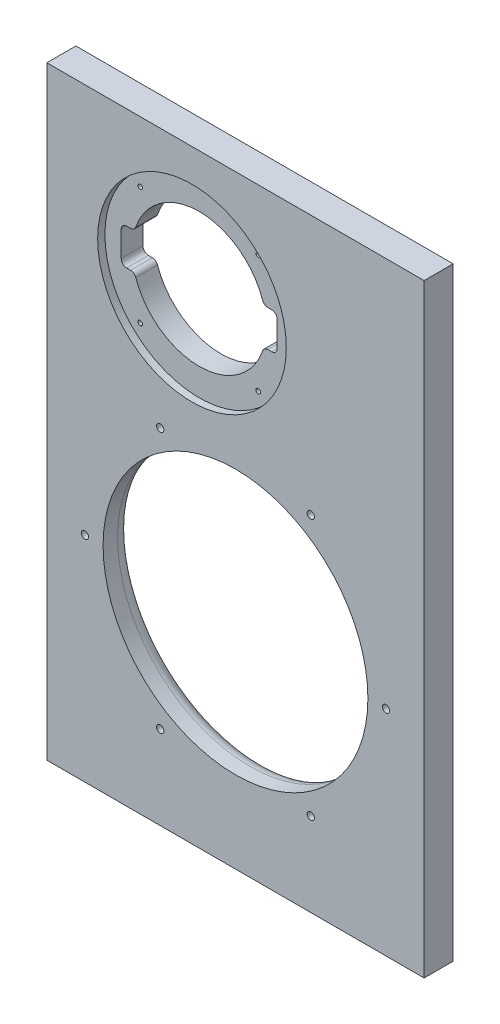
ISO-10303-21;
HEADER;
FILE_DESCRIPTION(('STEP AP214'),'2;1');
FILE_NAME('part.step','',(''),(''),'','','');
FILE_SCHEMA(('AUTOMOTIVE_DESIGN { 1 0 10303 214 1 1 1 1 }'));
ENDSEC;
DATA;
#1=APPLICATION_CONTEXT('core data for automotive mechanical design processes');
#2=APPLICATION_PROTOCOL_DEFINITION('international standard','automotive_design',2000,#1);
#3=PRODUCT_CONTEXT('',#1,'mechanical');
#4=PRODUCT('Part','Part','',(#3));
#5=PRODUCT_RELATED_PRODUCT_CATEGORY('part','',(#4));
#6=PRODUCT_DEFINITION_FORMATION('','',#4);
#7=PRODUCT_DEFINITION_CONTEXT('part definition',#1,'design');
#8=PRODUCT_DEFINITION('design','',#6,#7);
#9=PRODUCT_DEFINITION_SHAPE('','',#8);
#10=(LENGTH_UNIT() NAMED_UNIT(*) SI_UNIT(.MILLI.,.METRE.));
#11=(NAMED_UNIT(*) PLANE_ANGLE_UNIT() SI_UNIT($,.RADIAN.));
#12=(NAMED_UNIT(*) SI_UNIT($,.STERADIAN.) SOLID_ANGLE_UNIT());
#13=UNCERTAINTY_MEASURE_WITH_UNIT(LENGTH_MEASURE(1.E-05),#10,'distance_accuracy_value','');
#14=(GEOMETRIC_REPRESENTATION_CONTEXT(3) GLOBAL_UNCERTAINTY_ASSIGNED_CONTEXT((#13)) GLOBAL_UNIT_ASSIGNED_CONTEXT((#10,
#11,#12)) REPRESENTATION_CONTEXT('',''));
#15=CARTESIAN_POINT('',(0.,0.,0.));
#16=DIRECTION('',(0.,0.,1.));
#17=DIRECTION('',(1.,0.,0.));
#18=AXIS2_PLACEMENT_3D('',#15,#16,#17);
#19=CARTESIAN_POINT('',(40.,-72.997326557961,0.));
#20=DIRECTION('',(0.,0.,1.));
#21=DIRECTION('',(1.,0.,0.));
#22=AXIS2_PLACEMENT_3D('',#19,#20,#21);
#23=CYLINDRICAL_SURFACE('',#22,3.);
#24=CARTESIAN_POINT('',(40.,-72.997326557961,12.));
#25=DIRECTION('',(0.,0.,1.));
#26=DIRECTION('',(1.,0.,0.));
#27=AXIS2_PLACEMENT_3D('',#24,#25,#26);
#28=CIRCLE('',#27,3.);
#29=CARTESIAN_POINT('',(37.,-72.997326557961,12.));
#30=VERTEX_POINT('',#29);
#31=CARTESIAN_POINT('',(40.,-69.997326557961,12.));
#32=VERTEX_POINT('',#31);
#33=EDGE_CURVE('E187',#30,#32,#28,.F.);
#34=ORIENTED_EDGE('',*,*,#33,.F.);
#35=DIRECTION('',(0.,0.,1.));
#36=VECTOR('',#35,1.);
#37=CARTESIAN_POINT('',(37.,-72.997326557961,0.));
#38=LINE('',#37,#36);
#39=CARTESIAN_POINT('',(37.,-72.997326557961,0.));
#40=VERTEX_POINT('',#39);
#41=EDGE_CURVE('E201',#40,#30,#38,.T.);
#42=ORIENTED_EDGE('',*,*,#41,.F.);
#43=CARTESIAN_POINT('',(40.,-72.997326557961,0.));
#44=DIRECTION('',(0.,0.,1.));
#45=DIRECTION('',(-1.,0.,0.));
#46=AXIS2_PLACEMENT_3D('',#43,#44,#45);
#47=CIRCLE('',#46,3.);
#48=CARTESIAN_POINT('',(40.,-69.997326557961,0.));
#49=VERTEX_POINT('',#48);
#50=EDGE_CURVE('E204',#49,#40,#47,.T.);
#51=ORIENTED_EDGE('',*,*,#50,.F.);
#52=DIRECTION('',(0.,0.,1.));
#53=VECTOR('',#52,1.);
#54=CARTESIAN_POINT('',(40.,-69.997326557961,0.));
#55=LINE('',#54,#53);
#56=EDGE_CURVE('E203',#49,#32,#55,.T.);
#57=ORIENTED_EDGE('',*,*,#56,.T.);
#58=EDGE_LOOP('',(#34,#42,#51,#57));
#59=FACE_BOUND('',#58,.T.);
#60=ADVANCED_FACE('F31',(#59),#23,.F.);
#61=CARTESIAN_POINT('',(40.,-69.997326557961,0.));
#62=DIRECTION('',(0.,1.,0.));
#63=DIRECTION('',(0.,0.,1.));
#64=AXIS2_PLACEMENT_3D('',#61,#62,#63);
#65=PLANE('',#64);
#66=DIRECTION('',(1.,0.,0.));
#67=VECTOR('',#66,1.);
#68=CARTESIAN_POINT('',(40.,-69.997326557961,12.));
#69=LINE('',#68,#67);
#70=CARTESIAN_POINT('',(42.1714393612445,-69.997326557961,12.));
#71=VERTEX_POINT('',#70);
#72=EDGE_CURVE('E205',#32,#71,#69,.T.);
#73=ORIENTED_EDGE('',*,*,#72,.F.);
#74=ORIENTED_EDGE('',*,*,#56,.F.);
#75=DIRECTION('',(-1.,0.,0.));
#76=VECTOR('',#75,1.);
#77=CARTESIAN_POINT('',(40.,-69.997326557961,0.));
#78=LINE('',#77,#76);
#79=CARTESIAN_POINT('',(42.1714393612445,-69.997326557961,0.));
#80=VERTEX_POINT('',#79);
#81=EDGE_CURVE('E212',#80,#49,#78,.T.);
#82=ORIENTED_EDGE('',*,*,#81,.F.);
#83=DIRECTION('',(0.,0.,1.));
#84=VECTOR('',#83,1.);
#85=CARTESIAN_POINT('',(42.1714393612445,-69.997326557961,0.));
#86=LINE('',#85,#84);
#87=EDGE_CURVE('E377',#80,#71,#86,.T.);
#88=ORIENTED_EDGE('',*,*,#87,.T.);
#89=EDGE_LOOP('',(#73,#74,#82,#88));
#90=FACE_BOUND('',#89,.T.);
#91=ADVANCED_FACE('F423',(#90),#65,.F.);
#92=CARTESIAN_POINT('',(42.1714393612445,-66.9973265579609,0.));
#93=DIRECTION('',(0.,0.,1.));
#94=DIRECTION('',(1.,0.,0.));
#95=AXIS2_PLACEMENT_3D('',#92,#93,#94);
#96=CYLINDRICAL_SURFACE('',#95,3.);
#97=CARTESIAN_POINT('',(42.1714393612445,-66.9973265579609,12.));
#98=DIRECTION('',(0.,0.,1.));
#99=DIRECTION('',(1.,0.,0.));
#100=AXIS2_PLACEMENT_3D('',#97,#98,#99);
#101=CIRCLE('',#100,3.);
#102=CARTESIAN_POINT('',(45.0085814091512,-67.972326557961,12.));
#103=VERTEX_POINT('',#102);
#104=EDGE_CURVE('E333',#71,#103,#101,.T.);
#105=ORIENTED_EDGE('',*,*,#104,.F.);
#106=ORIENTED_EDGE('',*,*,#87,.F.);
#107=CARTESIAN_POINT('',(42.1714393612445,-66.9973265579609,0.));
#108=DIRECTION('',(0.,0.,-1.));
#109=DIRECTION('',(1.,0.,0.));
#110=AXIS2_PLACEMENT_3D('',#107,#108,#109);
#111=CIRCLE('',#110,3.);
#112=CARTESIAN_POINT('',(45.0085814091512,-67.972326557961,0.));
#113=VERTEX_POINT('',#112);
#114=EDGE_CURVE('E217',#113,#80,#111,.T.);
#115=ORIENTED_EDGE('',*,*,#114,.F.);
#116=DIRECTION('',(0.,0.,1.));
#117=VECTOR('',#116,1.);
#118=CARTESIAN_POINT('',(45.0085814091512,-67.972326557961,0.));
#119=LINE('',#118,#117);
#120=EDGE_CURVE('E380',#113,#103,#119,.T.);
#121=ORIENTED_EDGE('',*,*,#120,.T.);
#122=EDGE_LOOP('',(#105,#106,#115,#121));
#123=FACE_BOUND('',#122,.T.);
#124=ADVANCED_FACE('F427',(#123),#96,.T.);
#125=CARTESIAN_POINT('',(80.,-79.997326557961,0.));
#126=DIRECTION('',(0.,0.,1.));
#127=DIRECTION('',(1.,0.,0.));
#128=AXIS2_PLACEMENT_3D('',#125,#126,#127);
#129=CYLINDRICAL_SURFACE('',#128,37.);
#130=CARTESIAN_POINT('',(80.,-79.997326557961,12.));
#131=DIRECTION('',(0.,0.,1.));
#132=DIRECTION('',(1.,0.,0.));
#133=AXIS2_PLACEMENT_3D('',#130,#131,#132);
#134=CIRCLE('',#133,37.);
#135=CARTESIAN_POINT('',(114.991418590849,-67.972326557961,12.));
#136=VERTEX_POINT('',#135);
#137=EDGE_CURVE('E331',#103,#136,#134,.F.);
#138=ORIENTED_EDGE('',*,*,#137,.F.);
#139=ORIENTED_EDGE('',*,*,#120,.F.);
#140=CARTESIAN_POINT('',(80.,-79.997326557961,0.));
#141=DIRECTION('',(0.,0.,1.));
#142=DIRECTION('',(1.,0.,0.));
#143=AXIS2_PLACEMENT_3D('',#140,#141,#142);
#144=CIRCLE('',#143,37.);
#145=CARTESIAN_POINT('',(114.991418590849,-67.972326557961,0.));
#146=VERTEX_POINT('',#145);
#147=EDGE_CURVE('E371',#146,#113,#144,.T.);
#148=ORIENTED_EDGE('',*,*,#147,.F.);
#149=DIRECTION('',(0.,0.,1.));
#150=VECTOR('',#149,1.);
#151=CARTESIAN_POINT('',(114.991418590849,-67.972326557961,0.));
#152=LINE('',#151,#150);
#153=EDGE_CURVE('E383',#146,#136,#152,.T.);
#154=ORIENTED_EDGE('',*,*,#153,.T.);
#155=EDGE_LOOP('',(#138,#139,#148,#154));
#156=FACE_BOUND('',#155,.T.);
#157=ADVANCED_FACE('F430',(#156),#129,.F.);
#158=CARTESIAN_POINT('',(117.828560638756,-66.9973265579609,0.));
#159=DIRECTION('',(0.,0.,1.));
#160=DIRECTION('',(1.,0.,0.));
#161=AXIS2_PLACEMENT_3D('',#158,#159,#160);
#162=CYLINDRICAL_SURFACE('',#161,3.);
#163=CARTESIAN_POINT('',(117.828560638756,-66.9973265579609,12.));
#164=DIRECTION('',(0.,0.,1.));
#165=DIRECTION('',(1.,0.,0.));
#166=AXIS2_PLACEMENT_3D('',#163,#164,#165);
#167=CIRCLE('',#166,3.);
#168=CARTESIAN_POINT('',(117.828560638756,-69.997326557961,12.));
#169=VERTEX_POINT('',#168);
#170=EDGE_CURVE('E329',#136,#169,#167,.T.);
#171=ORIENTED_EDGE('',*,*,#170,.F.);
#172=ORIENTED_EDGE('',*,*,#153,.F.);
#173=CARTESIAN_POINT('',(117.828560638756,-66.9973265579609,0.));
#174=DIRECTION('',(0.,0.,-1.));
#175=DIRECTION('',(1.,0.,0.));
#176=AXIS2_PLACEMENT_3D('',#173,#174,#175);
#177=CIRCLE('',#176,3.);
#178=CARTESIAN_POINT('',(117.828560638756,-69.997326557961,0.));
#179=VERTEX_POINT('',#178);
#180=EDGE_CURVE('E368',#179,#146,#177,.T.);
#181=ORIENTED_EDGE('',*,*,#180,.F.);
#182=DIRECTION('',(0.,0.,1.));
#183=VECTOR('',#182,1.);
#184=CARTESIAN_POINT('',(117.828560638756,-69.997326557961,0.));
#185=LINE('',#184,#183);
#186=EDGE_CURVE('E386',#179,#169,#185,.T.);
#187=ORIENTED_EDGE('',*,*,#186,.T.);
#188=EDGE_LOOP('',(#171,#172,#181,#187));
#189=FACE_BOUND('',#188,.T.);
#190=ADVANCED_FACE('F434',(#189),#162,.T.);
#191=CARTESIAN_POINT('',(117.828560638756,-69.997326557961,0.));
#192=DIRECTION('',(0.,1.,0.));
#193=DIRECTION('',(0.,0.,1.));
#194=AXIS2_PLACEMENT_3D('',#191,#192,#193);
#195=PLANE('',#194);
#196=DIRECTION('',(1.,0.,0.));
#197=VECTOR('',#196,1.);
#198=CARTESIAN_POINT('',(117.828560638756,-69.997326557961,12.));
#199=LINE('',#198,#197);
#200=CARTESIAN_POINT('',(120.,-69.997326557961,12.));
#201=VERTEX_POINT('',#200);
#202=EDGE_CURVE('E327',#169,#201,#199,.T.);
#203=ORIENTED_EDGE('',*,*,#202,.F.);
#204=ORIENTED_EDGE('',*,*,#186,.F.);
#205=DIRECTION('',(-1.,0.,0.));
#206=VECTOR('',#205,1.);
#207=CARTESIAN_POINT('',(117.828560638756,-69.997326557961,0.));
#208=LINE('',#207,#206);
#209=CARTESIAN_POINT('',(120.,-69.997326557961,0.));
#210=VERTEX_POINT('',#209);
#211=EDGE_CURVE('E365',#210,#179,#208,.T.);
#212=ORIENTED_EDGE('',*,*,#211,.F.);
#213=DIRECTION('',(0.,0.,1.));
#214=VECTOR('',#213,1.);
#215=CARTESIAN_POINT('',(120.,-69.997326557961,0.));
#216=LINE('',#215,#214);
#217=EDGE_CURVE('E389',#210,#201,#216,.T.);
#218=ORIENTED_EDGE('',*,*,#217,.T.);
#219=EDGE_LOOP('',(#203,#204,#212,#218));
#220=FACE_BOUND('',#219,.T.);
#221=ADVANCED_FACE('F438',(#220),#195,.F.);
#222=CARTESIAN_POINT('',(120.,-72.997326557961,0.));
#223=DIRECTION('',(0.,0.,1.));
#224=DIRECTION('',(1.,0.,0.));
#225=AXIS2_PLACEMENT_3D('',#222,#223,#224);
#226=CYLINDRICAL_SURFACE('',#225,3.);
#227=CARTESIAN_POINT('',(120.,-72.997326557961,12.));
#228=DIRECTION('',(0.,0.,1.));
#229=DIRECTION('',(1.,0.,0.));
#230=AXIS2_PLACEMENT_3D('',#227,#228,#229);
#231=CIRCLE('',#230,3.);
#232=CARTESIAN_POINT('',(123.,-72.997326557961,12.));
#233=VERTEX_POINT('',#232);
#234=EDGE_CURVE('E325',#201,#233,#231,.F.);
#235=ORIENTED_EDGE('',*,*,#234,.F.);
#236=ORIENTED_EDGE('',*,*,#217,.F.);
#237=CARTESIAN_POINT('',(120.,-72.997326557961,0.));
#238=DIRECTION('',(0.,0.,1.));
#239=DIRECTION('',(1.,0.,0.));
#240=AXIS2_PLACEMENT_3D('',#237,#238,#239);
#241=CIRCLE('',#240,3.);
#242=CARTESIAN_POINT('',(123.,-72.997326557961,0.));
#243=VERTEX_POINT('',#242);
#244=EDGE_CURVE('E362',#243,#210,#241,.T.);
#245=ORIENTED_EDGE('',*,*,#244,.F.);
#246=DIRECTION('',(0.,0.,1.));
#247=VECTOR('',#246,1.);
#248=CARTESIAN_POINT('',(123.,-72.997326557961,0.));
#249=LINE('',#248,#247);
#250=EDGE_CURVE('E392',#243,#233,#249,.T.);
#251=ORIENTED_EDGE('',*,*,#250,.T.);
#252=EDGE_LOOP('',(#235,#236,#245,#251));
#253=FACE_BOUND('',#252,.T.);
#254=ADVANCED_FACE('F442',(#253),#226,.F.);
#255=CARTESIAN_POINT('',(123.,-72.997326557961,0.));
#256=DIRECTION('',(1.,0.,0.));
#257=DIRECTION('',(0.,0.,-1.));
#258=AXIS2_PLACEMENT_3D('',#255,#256,#257);
#259=PLANE('',#258);
#260=DIRECTION('',(0.,-1.,0.));
#261=VECTOR('',#260,1.);
#262=CARTESIAN_POINT('',(123.,-72.997326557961,12.));
#263=LINE('',#262,#261);
#264=CARTESIAN_POINT('',(123.,-86.997326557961,12.));
#265=VERTEX_POINT('',#264);
#266=EDGE_CURVE('E323',#233,#265,#263,.T.);
#267=ORIENTED_EDGE('',*,*,#266,.F.);
#268=ORIENTED_EDGE('',*,*,#250,.F.);
#269=DIRECTION('',(0.,1.,0.));
#270=VECTOR('',#269,1.);
#271=CARTESIAN_POINT('',(123.,-72.997326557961,0.));
#272=LINE('',#271,#270);
#273=CARTESIAN_POINT('',(123.,-86.9973265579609,0.));
#274=VERTEX_POINT('',#273);
#275=EDGE_CURVE('E359',#274,#243,#272,.T.);
#276=ORIENTED_EDGE('',*,*,#275,.F.);
#277=DIRECTION('',(0.,0.,1.));
#278=VECTOR('',#277,1.);
#279=CARTESIAN_POINT('',(123.,-86.9973265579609,0.));
#280=LINE('',#279,#278);
#281=EDGE_CURVE('E395',#274,#265,#280,.T.);
#282=ORIENTED_EDGE('',*,*,#281,.T.);
#283=EDGE_LOOP('',(#267,#268,#276,#282));
#284=FACE_BOUND('',#283,.T.);
#285=ADVANCED_FACE('F446',(#284),#259,.F.);
#286=CARTESIAN_POINT('',(120.,-86.997326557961,0.));
#287=DIRECTION('',(0.,0.,1.));
#288=DIRECTION('',(1.,0.,0.));
#289=AXIS2_PLACEMENT_3D('',#286,#287,#288);
#290=CYLINDRICAL_SURFACE('',#289,3.);
#291=CARTESIAN_POINT('',(120.,-86.997326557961,12.));
#292=DIRECTION('',(0.,0.,1.));
#293=DIRECTION('',(1.,0.,0.));
#294=AXIS2_PLACEMENT_3D('',#291,#292,#293);
#295=CIRCLE('',#294,3.);
#296=CARTESIAN_POINT('',(120.,-89.997326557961,12.));
#297=VERTEX_POINT('',#296);
#298=EDGE_CURVE('E321',#265,#297,#295,.F.);
#299=ORIENTED_EDGE('',*,*,#298,.F.);
#300=ORIENTED_EDGE('',*,*,#281,.F.);
#301=CARTESIAN_POINT('',(120.,-86.997326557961,0.));
#302=DIRECTION('',(0.,0.,1.));
#303=DIRECTION('',(-1.,0.,0.));
#304=AXIS2_PLACEMENT_3D('',#301,#302,#303);
#305=CIRCLE('',#304,3.);
#306=CARTESIAN_POINT('',(120.,-89.997326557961,0.));
#307=VERTEX_POINT('',#306);
#308=EDGE_CURVE('E356',#307,#274,#305,.T.);
#309=ORIENTED_EDGE('',*,*,#308,.F.);
#310=DIRECTION('',(0.,0.,1.));
#311=VECTOR('',#310,1.);
#312=CARTESIAN_POINT('',(120.,-89.997326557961,0.));
#313=LINE('',#312,#311);
#314=EDGE_CURVE('E398',#307,#297,#313,.T.);
#315=ORIENTED_EDGE('',*,*,#314,.T.);
#316=EDGE_LOOP('',(#299,#300,#309,#315));
#317=FACE_BOUND('',#316,.T.);
#318=ADVANCED_FACE('F450',(#317),#290,.F.);
#319=CARTESIAN_POINT('',(117.828560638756,-89.997326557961,0.));
#320=DIRECTION('',(0.,-1.,0.));
#321=DIRECTION('',(0.,0.,-1.));
#322=AXIS2_PLACEMENT_3D('',#319,#320,#321);
#323=PLANE('',#322);
#324=DIRECTION('',(-1.,0.,0.));
#325=VECTOR('',#324,1.);
#326=CARTESIAN_POINT('',(117.828560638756,-89.997326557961,12.));
#327=LINE('',#326,#325);
#328=CARTESIAN_POINT('',(117.828560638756,-89.997326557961,12.));
#329=VERTEX_POINT('',#328);
#330=EDGE_CURVE('E319',#297,#329,#327,.T.);
#331=ORIENTED_EDGE('',*,*,#330,.F.);
#332=ORIENTED_EDGE('',*,*,#314,.F.);
#333=DIRECTION('',(1.,0.,0.));
#334=VECTOR('',#333,1.);
#335=CARTESIAN_POINT('',(117.828560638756,-89.997326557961,0.));
#336=LINE('',#335,#334);
#337=CARTESIAN_POINT('',(117.828560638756,-89.997326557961,0.));
#338=VERTEX_POINT('',#337);
#339=EDGE_CURVE('E353',#338,#307,#336,.T.);
#340=ORIENTED_EDGE('',*,*,#339,.F.);
#341=DIRECTION('',(0.,0.,1.));
#342=VECTOR('',#341,1.);
#343=CARTESIAN_POINT('',(117.828560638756,-89.997326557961,0.));
#344=LINE('',#343,#342);
#345=EDGE_CURVE('E401',#338,#329,#344,.T.);
#346=ORIENTED_EDGE('',*,*,#345,.T.);
#347=EDGE_LOOP('',(#331,#332,#340,#346));
#348=FACE_BOUND('',#347,.T.);
#349=ADVANCED_FACE('F454',(#348),#323,.F.);
#350=CARTESIAN_POINT('',(117.828560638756,-92.997326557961,0.));
#351=DIRECTION('',(0.,0.,1.));
#352=DIRECTION('',(1.,0.,0.));
#353=AXIS2_PLACEMENT_3D('',#350,#351,#352);
#354=CYLINDRICAL_SURFACE('',#353,3.00000000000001);
#355=CARTESIAN_POINT('',(117.828560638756,-92.997326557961,12.));
#356=DIRECTION('',(0.,0.,1.));
#357=DIRECTION('',(1.,0.,0.));
#358=AXIS2_PLACEMENT_3D('',#355,#356,#357);
#359=CIRCLE('',#358,3.00000000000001);
#360=CARTESIAN_POINT('',(114.991418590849,-92.022326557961,12.));
#361=VERTEX_POINT('',#360);
#362=EDGE_CURVE('E317',#329,#361,#359,.T.);
#363=ORIENTED_EDGE('',*,*,#362,.F.);
#364=ORIENTED_EDGE('',*,*,#345,.F.);
#365=CARTESIAN_POINT('',(117.828560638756,-92.997326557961,0.));
#366=DIRECTION('',(0.,0.,-1.));
#367=DIRECTION('',(-1.,0.,0.));
#368=AXIS2_PLACEMENT_3D('',#365,#366,#367);
#369=CIRCLE('',#368,3.00000000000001);
#370=CARTESIAN_POINT('',(114.991418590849,-92.022326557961,0.));
#371=VERTEX_POINT('',#370);
#372=EDGE_CURVE('E350',#371,#338,#369,.T.);
#373=ORIENTED_EDGE('',*,*,#372,.F.);
#374=DIRECTION('',(0.,0.,1.));
#375=VECTOR('',#374,1.);
#376=CARTESIAN_POINT('',(114.991418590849,-92.022326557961,0.));
#377=LINE('',#376,#375);
#378=EDGE_CURVE('E404',#371,#361,#377,.T.);
#379=ORIENTED_EDGE('',*,*,#378,.T.);
#380=EDGE_LOOP('',(#363,#364,#373,#379));
#381=FACE_BOUND('',#380,.T.);
#382=ADVANCED_FACE('F458',(#381),#354,.T.);
#383=CARTESIAN_POINT('',(80.,-79.997326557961,0.));
#384=DIRECTION('',(0.,0.,1.));
#385=DIRECTION('',(1.,0.,0.));
#386=AXIS2_PLACEMENT_3D('',#383,#384,#385);
#387=CYLINDRICAL_SURFACE('',#386,37.);
#388=CARTESIAN_POINT('',(80.,-79.997326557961,12.));
#389=DIRECTION('',(0.,0.,1.));
#390=DIRECTION('',(1.,0.,0.));
#391=AXIS2_PLACEMENT_3D('',#388,#389,#390);
#392=CIRCLE('',#391,37.);
#393=CARTESIAN_POINT('',(45.0085814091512,-92.022326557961,12.));
#394=VERTEX_POINT('',#393);
#395=EDGE_CURVE('E315',#361,#394,#392,.F.);
#396=ORIENTED_EDGE('',*,*,#395,.F.);
#397=ORIENTED_EDGE('',*,*,#378,.F.);
#398=CARTESIAN_POINT('',(80.,-79.997326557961,0.));
#399=DIRECTION('',(0.,0.,1.));
#400=DIRECTION('',(1.,0.,0.));
#401=AXIS2_PLACEMENT_3D('',#398,#399,#400);
#402=CIRCLE('',#401,37.);
#403=CARTESIAN_POINT('',(45.0085814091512,-92.022326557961,0.));
#404=VERTEX_POINT('',#403);
#405=EDGE_CURVE('E347',#404,#371,#402,.T.);
#406=ORIENTED_EDGE('',*,*,#405,.F.);
#407=DIRECTION('',(0.,0.,1.));
#408=VECTOR('',#407,1.);
#409=CARTESIAN_POINT('',(45.0085814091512,-92.022326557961,0.));
#410=LINE('',#409,#408);
#411=EDGE_CURVE('E407',#404,#394,#410,.T.);
#412=ORIENTED_EDGE('',*,*,#411,.T.);
#413=EDGE_LOOP('',(#396,#397,#406,#412));
#414=FACE_BOUND('',#413,.T.);
#415=ADVANCED_FACE('F462',(#414),#387,.F.);
#416=CARTESIAN_POINT('',(42.1714393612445,-92.997326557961,0.));
#417=DIRECTION('',(0.,0.,1.));
#418=DIRECTION('',(1.,0.,0.));
#419=AXIS2_PLACEMENT_3D('',#416,#417,#418);
#420=CYLINDRICAL_SURFACE('',#419,3.);
#421=CARTESIAN_POINT('',(42.1714393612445,-92.997326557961,12.));
#422=DIRECTION('',(0.,0.,1.));
#423=DIRECTION('',(1.,0.,0.));
#424=AXIS2_PLACEMENT_3D('',#421,#422,#423);
#425=CIRCLE('',#424,3.);
#426=CARTESIAN_POINT('',(42.1714393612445,-89.997326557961,12.));
#427=VERTEX_POINT('',#426);
#428=EDGE_CURVE('E313',#394,#427,#425,.T.);
#429=ORIENTED_EDGE('',*,*,#428,.F.);
#430=ORIENTED_EDGE('',*,*,#411,.F.);
#431=CARTESIAN_POINT('',(42.1714393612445,-92.997326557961,0.));
#432=DIRECTION('',(0.,0.,-1.));
#433=DIRECTION('',(-1.,0.,0.));
#434=AXIS2_PLACEMENT_3D('',#431,#432,#433);
#435=CIRCLE('',#434,3.);
#436=CARTESIAN_POINT('',(42.1714393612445,-89.997326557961,0.));
#437=VERTEX_POINT('',#436);
#438=EDGE_CURVE('E344',#437,#404,#435,.T.);
#439=ORIENTED_EDGE('',*,*,#438,.F.);
#440=DIRECTION('',(0.,0.,1.));
#441=VECTOR('',#440,1.);
#442=CARTESIAN_POINT('',(42.1714393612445,-89.997326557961,0.));
#443=LINE('',#442,#441);
#444=EDGE_CURVE('E410',#437,#427,#443,.T.);
#445=ORIENTED_EDGE('',*,*,#444,.T.);
#446=EDGE_LOOP('',(#429,#430,#439,#445));
#447=FACE_BOUND('',#446,.T.);
#448=ADVANCED_FACE('F465',(#447),#420,.T.);
#449=CARTESIAN_POINT('',(40.,-89.997326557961,0.));
#450=DIRECTION('',(0.,-1.,0.));
#451=DIRECTION('',(0.,0.,-1.));
#452=AXIS2_PLACEMENT_3D('',#449,#450,#451);
#453=PLANE('',#452);
#454=DIRECTION('',(-1.,0.,0.));
#455=VECTOR('',#454,1.);
#456=CARTESIAN_POINT('',(40.,-89.997326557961,12.));
#457=LINE('',#456,#455);
#458=CARTESIAN_POINT('',(40.,-89.997326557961,12.));
#459=VERTEX_POINT('',#458);
#460=EDGE_CURVE('E311',#427,#459,#457,.T.);
#461=ORIENTED_EDGE('',*,*,#460,.F.);
#462=ORIENTED_EDGE('',*,*,#444,.F.);
#463=DIRECTION('',(1.,0.,0.));
#464=VECTOR('',#463,1.);
#465=CARTESIAN_POINT('',(40.,-89.997326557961,0.));
#466=LINE('',#465,#464);
#467=CARTESIAN_POINT('',(40.,-89.997326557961,0.));
#468=VERTEX_POINT('',#467);
#469=EDGE_CURVE('E341',#468,#437,#466,.T.);
#470=ORIENTED_EDGE('',*,*,#469,.F.);
#471=DIRECTION('',(0.,0.,1.));
#472=VECTOR('',#471,1.);
#473=CARTESIAN_POINT('',(40.,-89.997326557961,0.));
#474=LINE('',#473,#472);
#475=EDGE_CURVE('E214',#468,#459,#474,.T.);
#476=ORIENTED_EDGE('',*,*,#475,.T.);
#477=EDGE_LOOP('',(#461,#462,#470,#476));
#478=FACE_BOUND('',#477,.T.);
#479=ADVANCED_FACE('F416',(#478),#453,.F.);
#480=CARTESIAN_POINT('',(40.,-86.997326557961,0.));
#481=DIRECTION('',(0.,0.,1.));
#482=DIRECTION('',(1.,0.,0.));
#483=AXIS2_PLACEMENT_3D('',#480,#481,#482);
#484=CYLINDRICAL_SURFACE('',#483,3.);
#485=CARTESIAN_POINT('',(40.,-86.997326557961,12.));
#486=DIRECTION('',(0.,0.,1.));
#487=DIRECTION('',(1.,0.,0.));
#488=AXIS2_PLACEMENT_3D('',#485,#486,#487);
#489=CIRCLE('',#488,3.);
#490=CARTESIAN_POINT('',(37.,-86.9973265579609,12.));
#491=VERTEX_POINT('',#490);
#492=EDGE_CURVE('E190',#459,#491,#489,.F.);
#493=ORIENTED_EDGE('',*,*,#492,.F.);
#494=ORIENTED_EDGE('',*,*,#475,.F.);
#495=CARTESIAN_POINT('',(40.,-86.997326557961,0.));
#496=DIRECTION('',(0.,0.,1.));
#497=DIRECTION('',(1.,0.,0.));
#498=AXIS2_PLACEMENT_3D('',#495,#496,#497);
#499=CIRCLE('',#498,3.);
#500=CARTESIAN_POINT('',(37.,-86.9973265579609,0.));
#501=VERTEX_POINT('',#500);
#502=EDGE_CURVE('E338',#501,#468,#499,.T.);
#503=ORIENTED_EDGE('',*,*,#502,.F.);
#504=DIRECTION('',(0.,0.,1.));
#505=VECTOR('',#504,1.);
#506=CARTESIAN_POINT('',(37.,-86.9973265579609,0.));
#507=LINE('',#506,#505);
#508=EDGE_CURVE('E211',#501,#491,#507,.T.);
#509=ORIENTED_EDGE('',*,*,#508,.T.);
#510=EDGE_LOOP('',(#493,#494,#503,#509));
#511=FACE_BOUND('',#510,.T.);
#512=ADVANCED_FACE('F418',(#511),#484,.F.);
#513=CARTESIAN_POINT('',(37.,-72.997326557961,0.));
#514=DIRECTION('',(-1.,0.,0.));
#515=DIRECTION('',(0.,0.,1.));
#516=AXIS2_PLACEMENT_3D('',#513,#514,#515);
#517=PLANE('',#516);
#518=DIRECTION('',(0.,1.,0.));
#519=VECTOR('',#518,1.);
#520=CARTESIAN_POINT('',(37.,-72.997326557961,12.));
#521=LINE('',#520,#519);
#522=EDGE_CURVE('E184',#491,#30,#521,.T.);
#523=ORIENTED_EDGE('',*,*,#522,.F.);
#524=ORIENTED_EDGE('',*,*,#508,.F.);
#525=DIRECTION('',(0.,-1.,0.));
#526=VECTOR('',#525,1.);
#527=CARTESIAN_POINT('',(37.,-72.997326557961,0.));
#528=LINE('',#527,#526);
#529=EDGE_CURVE('E209',#40,#501,#528,.T.);
#530=ORIENTED_EDGE('',*,*,#529,.F.);
#531=ORIENTED_EDGE('',*,*,#41,.T.);
#532=EDGE_LOOP('',(#523,#524,#530,#531));
#533=FACE_BOUND('',#532,.T.);
#534=ADVANCED_FACE('F207',(#533),#517,.F.);
#535=CARTESIAN_POINT('',(208.,-10.,16.));
#536=DIRECTION('',(-1.,0.,0.));
#537=DIRECTION('',(0.,-1.,0.));
#538=AXIS2_PLACEMENT_3D('',#535,#536,#537);
#539=PLANE('',#538);
#540=DIRECTION('',(0.,1.,0.));
#541=VECTOR('',#540,1.);
#542=CARTESIAN_POINT('',(208.,-10.,0.));
#543=LINE('',#542,#541);
#544=CARTESIAN_POINT('',(208.,-343.,0.));
#545=VERTEX_POINT('',#544);
#546=CARTESIAN_POINT('',(208.,-10.,0.));
#547=VERTEX_POINT('',#546);
#548=EDGE_CURVE('E224',#545,#547,#543,.T.);
#549=ORIENTED_EDGE('',*,*,#548,.T.);
#550=DIRECTION('',(0.,0.,-1.));
#551=VECTOR('',#550,1.);
#552=CARTESIAN_POINT('',(208.,-10.,16.));
#553=LINE('',#552,#551);
#554=CARTESIAN_POINT('',(208.,-10.,16.));
#555=VERTEX_POINT('',#554);
#556=EDGE_CURVE('E196',#555,#547,#553,.T.);
#557=ORIENTED_EDGE('',*,*,#556,.F.);
#558=DIRECTION('',(0.,1.,0.));
#559=VECTOR('',#558,1.);
#560=CARTESIAN_POINT('',(208.,-10.,16.));
#561=LINE('',#560,#559);
#562=CARTESIAN_POINT('',(208.,-343.,16.));
#563=VERTEX_POINT('',#562);
#564=EDGE_CURVE('E225',#563,#555,#561,.T.);
#565=ORIENTED_EDGE('',*,*,#564,.F.);
#566=DIRECTION('',(0.,0.,-1.));
#567=VECTOR('',#566,1.);
#568=CARTESIAN_POINT('',(208.,-343.,16.));
#569=LINE('',#568,#567);
#570=EDGE_CURVE('E235',#563,#545,#569,.T.);
#571=ORIENTED_EDGE('',*,*,#570,.T.);
#572=EDGE_LOOP('',(#549,#557,#565,#571));
#573=FACE_BOUND('',#572,.T.);
#574=ADVANCED_FACE('F505',(#573),#539,.F.);
#575=CARTESIAN_POINT('',(0.,-10.,16.));
#576=DIRECTION('',(0.,-1.,0.));
#577=DIRECTION('',(0.,0.,-1.));
#578=AXIS2_PLACEMENT_3D('',#575,#576,#577);
#579=PLANE('',#578);
#580=DIRECTION('',(-1.,0.,0.));
#581=VECTOR('',#580,1.);
#582=CARTESIAN_POINT('',(0.,-10.,0.));
#583=LINE('',#582,#581);
#584=CARTESIAN_POINT('',(0.,-10.,0.));
#585=VERTEX_POINT('',#584);
#586=EDGE_CURVE('E238',#547,#585,#583,.T.);
#587=ORIENTED_EDGE('',*,*,#586,.T.);
#588=DIRECTION('',(0.,0.,-1.));
#589=VECTOR('',#588,1.);
#590=CARTESIAN_POINT('',(0.,-10.,16.));
#591=LINE('',#590,#589);
#592=CARTESIAN_POINT('',(0.,-10.,16.));
#593=VERTEX_POINT('',#592);
#594=EDGE_CURVE('E248',#593,#585,#591,.T.);
#595=ORIENTED_EDGE('',*,*,#594,.F.);
#596=DIRECTION('',(-1.,0.,0.));
#597=VECTOR('',#596,1.);
#598=CARTESIAN_POINT('',(0.,-10.,16.));
#599=LINE('',#598,#597);
#600=EDGE_CURVE('E228',#555,#593,#599,.T.);
#601=ORIENTED_EDGE('',*,*,#600,.F.);
#602=ORIENTED_EDGE('',*,*,#556,.T.);
#603=EDGE_LOOP('',(#587,#595,#601,#602));
#604=FACE_BOUND('',#603,.T.);
#605=ADVANCED_FACE('F502',(#604),#579,.F.);
#606=CARTESIAN_POINT('',(0.,-10.,16.));
#607=DIRECTION('',(1.,0.,0.));
#608=DIRECTION('',(0.,1.,0.));
#609=AXIS2_PLACEMENT_3D('',#606,#607,#608);
#610=PLANE('',#609);
#611=DIRECTION('',(0.,-1.,0.));
#612=VECTOR('',#611,1.);
#613=CARTESIAN_POINT('',(0.,-10.,0.));
#614=LINE('',#613,#612);
#615=CARTESIAN_POINT('',(0.,-343.,0.));
#616=VERTEX_POINT('',#615);
#617=EDGE_CURVE('E240',#585,#616,#614,.T.);
#618=ORIENTED_EDGE('',*,*,#617,.T.);
#619=DIRECTION('',(0.,0.,-1.));
#620=VECTOR('',#619,1.);
#621=CARTESIAN_POINT('',(0.,-343.,16.));
#622=LINE('',#621,#620);
#623=CARTESIAN_POINT('',(0.,-343.,16.));
#624=VERTEX_POINT('',#623);
#625=EDGE_CURVE('E245',#624,#616,#622,.T.);
#626=ORIENTED_EDGE('',*,*,#625,.F.);
#627=DIRECTION('',(0.,-1.,0.));
#628=VECTOR('',#627,1.);
#629=CARTESIAN_POINT('',(0.,-10.,16.));
#630=LINE('',#629,#628);
#631=EDGE_CURVE('E231',#593,#624,#630,.T.);
#632=ORIENTED_EDGE('',*,*,#631,.F.);
#633=ORIENTED_EDGE('',*,*,#594,.T.);
#634=EDGE_LOOP('',(#618,#626,#632,#633));
#635=FACE_BOUND('',#634,.T.);
#636=ADVANCED_FACE('F498',(#635),#610,.F.);
#637=CARTESIAN_POINT('',(0.,-343.,16.));
#638=DIRECTION('',(0.,1.,0.));
#639=DIRECTION('',(0.,0.,1.));
#640=AXIS2_PLACEMENT_3D('',#637,#638,#639);
#641=PLANE('',#640);
#642=DIRECTION('',(1.,0.,0.));
#643=VECTOR('',#642,1.);
#644=CARTESIAN_POINT('',(0.,-343.,0.));
#645=LINE('',#644,#643);
#646=EDGE_CURVE('E229',#616,#545,#645,.T.);
#647=ORIENTED_EDGE('',*,*,#646,.T.);
#648=ORIENTED_EDGE('',*,*,#570,.F.);
#649=DIRECTION('',(1.,0.,0.));
#650=VECTOR('',#649,1.);
#651=CARTESIAN_POINT('',(0.,-343.,16.));
#652=LINE('',#651,#650);
#653=EDGE_CURVE('E233',#624,#563,#652,.T.);
#654=ORIENTED_EDGE('',*,*,#653,.F.);
#655=ORIENTED_EDGE('',*,*,#625,.T.);
#656=EDGE_LOOP('',(#647,#648,#654,#655));
#657=FACE_BOUND('',#656,.T.);
#658=ADVANCED_FACE('F491',(#657),#641,.F.);
#659=CARTESIAN_POINT('',(208.,-343.,16.));
#660=DIRECTION('',(0.,0.,1.));
#661=DIRECTION('',(1.,0.,0.));
#662=AXIS2_PLACEMENT_3D('',#659,#660,#661);
#663=PLANE('',#662);
#664=CARTESIAN_POINT('',(62.4999999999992,-296.877435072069,16.));
#665=DIRECTION('',(0.,0.,1.));
#666=DIRECTION('',(1.,0.,0.));
#667=AXIS2_PLACEMENT_3D('',#664,#665,#666);
#668=CIRCLE('',#667,2.00000000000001);
#669=CARTESIAN_POINT('',(64.4999999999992,-296.877435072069,16.));
#670=VERTEX_POINT('',#669);
#671=EDGE_CURVE('E256',#670,#670,#668,.T.);
#672=ORIENTED_EDGE('',*,*,#671,.F.);
#673=EDGE_LOOP('',(#672));
#674=FACE_BOUND('',#673,.T.);
#675=CARTESIAN_POINT('',(145.499999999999,-296.87743507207,16.));
#676=DIRECTION('',(0.,0.,1.));
#677=DIRECTION('',(1.,0.,0.));
#678=AXIS2_PLACEMENT_3D('',#675,#676,#677);
#679=CIRCLE('',#678,1.99999999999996);
#680=CARTESIAN_POINT('',(147.499999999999,-296.87743507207,16.));
#681=VERTEX_POINT('',#680);
#682=EDGE_CURVE('E805',#681,#681,#679,.T.);
#683=ORIENTED_EDGE('',*,*,#682,.F.);
#684=EDGE_LOOP('',(#683));
#685=FACE_BOUND('',#684,.T.);
#686=CARTESIAN_POINT('',(187.,-224.997326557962,16.));
#687=DIRECTION('',(0.,0.,1.));
#688=DIRECTION('',(1.,0.,0.));
#689=AXIS2_PLACEMENT_3D('',#686,#687,#688);
#690=CIRCLE('',#689,1.99999999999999);
#691=CARTESIAN_POINT('',(189.,-224.997326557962,16.));
#692=VERTEX_POINT('',#691);
#693=EDGE_CURVE('E811',#692,#692,#690,.T.);
#694=ORIENTED_EDGE('',*,*,#693,.F.);
#695=EDGE_LOOP('',(#694));
#696=FACE_BOUND('',#695,.T.);
#697=CARTESIAN_POINT('',(145.5,-153.117218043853,16.));
#698=DIRECTION('',(0.,0.,1.));
#699=DIRECTION('',(1.,0.,0.));
#700=AXIS2_PLACEMENT_3D('',#697,#698,#699);
#701=CIRCLE('',#700,2.00000000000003);
#702=CARTESIAN_POINT('',(147.5,-153.117218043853,16.));
#703=VERTEX_POINT('',#702);
#704=EDGE_CURVE('E815',#703,#703,#701,.T.);
#705=ORIENTED_EDGE('',*,*,#704,.F.);
#706=EDGE_LOOP('',(#705));
#707=FACE_BOUND('',#706,.T.);
#708=CARTESIAN_POINT('',(62.5000000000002,-153.117218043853,16.));
#709=DIRECTION('',(0.,0.,1.));
#710=DIRECTION('',(1.,0.,0.));
#711=AXIS2_PLACEMENT_3D('',#708,#709,#710);
#712=CIRCLE('',#711,2.);
#713=CARTESIAN_POINT('',(64.5000000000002,-153.117218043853,16.));
#714=VERTEX_POINT('',#713);
#715=EDGE_CURVE('E305',#714,#714,#712,.T.);
#716=ORIENTED_EDGE('',*,*,#715,.F.);
#717=EDGE_LOOP('',(#716));
#718=FACE_BOUND('',#717,.T.);
#719=CARTESIAN_POINT('',(21.0000000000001,-224.997326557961,16.));
#720=DIRECTION('',(0.,0.,1.));
#721=DIRECTION('',(1.,0.,0.));
#722=AXIS2_PLACEMENT_3D('',#719,#720,#721);
#723=CIRCLE('',#722,2.);
#724=CARTESIAN_POINT('',(23.0000000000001,-224.997326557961,16.));
#725=VERTEX_POINT('',#724);
#726=EDGE_CURVE('E296',#725,#725,#723,.T.);
#727=ORIENTED_EDGE('',*,*,#726,.F.);
#728=EDGE_LOOP('',(#727));
#729=FACE_BOUND('',#728,.T.);
#730=CARTESIAN_POINT('',(80.,-79.997326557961,16.));
#731=DIRECTION('',(0.,0.,1.));
#732=DIRECTION('',(1.,0.,0.));
#733=AXIS2_PLACEMENT_3D('',#730,#731,#732);
#734=CIRCLE('',#733,52.);
#735=CARTESIAN_POINT('',(132.,-79.997326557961,16.));
#736=VERTEX_POINT('',#735);
#737=EDGE_CURVE('E295',#736,#736,#734,.T.);
#738=ORIENTED_EDGE('',*,*,#737,.F.);
#739=EDGE_LOOP('',(#738));
#740=FACE_BOUND('',#739,.T.);
#741=CARTESIAN_POINT('',(104.,-224.997326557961,16.));
#742=DIRECTION('',(0.,0.,1.));
#743=DIRECTION('',(1.,0.,0.));
#744=AXIS2_PLACEMENT_3D('',#741,#742,#743);
#745=CIRCLE('',#744,73.0000000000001);
#746=CARTESIAN_POINT('',(177.,-224.997326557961,16.));
#747=VERTEX_POINT('',#746);
#748=EDGE_CURVE('E221',#747,#747,#745,.T.);
#749=ORIENTED_EDGE('',*,*,#748,.F.);
#750=EDGE_LOOP('',(#749));
#751=FACE_BOUND('',#750,.T.);
#752=ORIENTED_EDGE('',*,*,#564,.T.);
#753=ORIENTED_EDGE('',*,*,#600,.T.);
#754=ORIENTED_EDGE('',*,*,#631,.T.);
#755=ORIENTED_EDGE('',*,*,#653,.T.);
#756=EDGE_LOOP('',(#752,#753,#754,#755));
#757=FACE_BOUND('',#756,.T.);
#758=ADVANCED_FACE('F488',(#674,#685,#696,#707,#718,#729,#740,#751,#757),#663,.T.);
#759=CARTESIAN_POINT('',(208.,-343.,0.));
#760=DIRECTION('',(0.,0.,1.));
#761=DIRECTION('',(1.,0.,0.));
#762=AXIS2_PLACEMENT_3D('',#759,#760,#761);
#763=PLANE('',#762);
#764=CARTESIAN_POINT('',(47.4730880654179,-47.4704146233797,0.));
#765=DIRECTION('',(0.,0.,1.));
#766=DIRECTION('',(1.,0.,0.));
#767=AXIS2_PLACEMENT_3D('',#764,#765,#766);
#768=CIRCLE('',#767,1.24999999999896);
#769=CARTESIAN_POINT('',(48.7230880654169,-47.4704146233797,0.));
#770=VERTEX_POINT('',#769);
#771=EDGE_CURVE('E269',#770,#770,#768,.T.);
#772=ORIENTED_EDGE('',*,*,#771,.T.);
#773=EDGE_LOOP('',(#772));
#774=FACE_BOUND('',#773,.T.);
#775=CARTESIAN_POINT('',(47.4730880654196,-112.524238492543,0.));
#776=DIRECTION('',(0.,0.,1.));
#777=DIRECTION('',(1.,0.,0.));
#778=AXIS2_PLACEMENT_3D('',#775,#776,#777);
#779=CIRCLE('',#778,1.24999999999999);
#780=CARTESIAN_POINT('',(48.7230880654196,-112.524238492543,0.));
#781=VERTEX_POINT('',#780);
#782=EDGE_CURVE('E265',#781,#781,#779,.T.);
#783=ORIENTED_EDGE('',*,*,#782,.T.);
#784=EDGE_LOOP('',(#783));
#785=FACE_BOUND('',#784,.T.);
#786=CARTESIAN_POINT('',(112.526911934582,-112.524238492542,0.));
#787=DIRECTION('',(0.,0.,1.));
#788=DIRECTION('',(1.,0.,0.));
#789=AXIS2_PLACEMENT_3D('',#786,#787,#788);
#790=CIRCLE('',#789,1.25);
#791=CARTESIAN_POINT('',(113.776911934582,-112.524238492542,0.));
#792=VERTEX_POINT('',#791);
#793=EDGE_CURVE('E261',#792,#792,#790,.T.);
#794=ORIENTED_EDGE('',*,*,#793,.T.);
#795=EDGE_LOOP('',(#794));
#796=FACE_BOUND('',#795,.T.);
#797=CARTESIAN_POINT('',(112.526911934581,-47.4704146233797,0.));
#798=DIRECTION('',(0.,0.,1.));
#799=DIRECTION('',(1.,0.,0.));
#800=AXIS2_PLACEMENT_3D('',#797,#798,#799);
#801=CIRCLE('',#800,1.25);
#802=CARTESIAN_POINT('',(113.776911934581,-47.4704146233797,0.));
#803=VERTEX_POINT('',#802);
#804=EDGE_CURVE('E257',#803,#803,#801,.T.);
#805=ORIENTED_EDGE('',*,*,#804,.T.);
#806=EDGE_LOOP('',(#805));
#807=FACE_BOUND('',#806,.T.);
#808=CARTESIAN_POINT('',(187.,-224.997326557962,0.));
#809=DIRECTION('',(0.,0.,1.));
#810=DIRECTION('',(1.,0.,0.));
#811=AXIS2_PLACEMENT_3D('',#808,#809,#810);
#812=CIRCLE('',#811,1.99999999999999);
#813=CARTESIAN_POINT('',(185.,-224.997326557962,0.));
#814=VERTEX_POINT('',#813);
#815=EDGE_CURVE('E284',#814,#814,#812,.T.);
#816=ORIENTED_EDGE('',*,*,#815,.T.);
#817=CARTESIAN_POINT('',(104.,-224.997326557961,0.));
#818=DIRECTION('',(0.,0.,1.));
#819=DIRECTION('',(1.,0.,0.));
#820=AXIS2_PLACEMENT_3D('',#817,#818,#819);
#821=CIRCLE('',#820,81.0000000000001);
#822=CARTESIAN_POINT('',(144.5,-154.849268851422,0.));
#823=VERTEX_POINT('',#822);
#824=EDGE_CURVE('E39',#814,#823,#821,.T.);
#825=ORIENTED_EDGE('',*,*,#824,.T.);
#826=CARTESIAN_POINT('',(145.5,-153.117218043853,0.));
#827=DIRECTION('',(0.,0.,1.));
#828=DIRECTION('',(1.,0.,0.));
#829=AXIS2_PLACEMENT_3D('',#826,#827,#828);
#830=CIRCLE('',#829,2.00000000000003);
#831=EDGE_CURVE('E282',#823,#823,#830,.T.);
#832=ORIENTED_EDGE('',*,*,#831,.T.);
#833=CARTESIAN_POINT('',(104.,-224.997326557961,0.));
#834=DIRECTION('',(0.,0.,1.));
#835=DIRECTION('',(1.,0.,0.));
#836=AXIS2_PLACEMENT_3D('',#833,#834,#835);
#837=CIRCLE('',#836,81.0000000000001);
#838=CARTESIAN_POINT('',(63.5000000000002,-154.849268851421,0.));
#839=VERTEX_POINT('',#838);
#840=EDGE_CURVE('E51',#823,#839,#837,.T.);
#841=ORIENTED_EDGE('',*,*,#840,.T.);
#842=CARTESIAN_POINT('',(62.5000000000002,-153.117218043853,0.));
#843=DIRECTION('',(0.,0.,1.));
#844=DIRECTION('',(1.,0.,0.));
#845=AXIS2_PLACEMENT_3D('',#842,#843,#844);
#846=CIRCLE('',#845,2.);
#847=EDGE_CURVE('E302',#839,#839,#846,.T.);
#848=ORIENTED_EDGE('',*,*,#847,.T.);
#849=CARTESIAN_POINT('',(104.,-224.997326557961,0.));
#850=DIRECTION('',(0.,0.,1.));
#851=DIRECTION('',(1.,0.,0.));
#852=AXIS2_PLACEMENT_3D('',#849,#850,#851);
#853=CIRCLE('',#852,81.0000000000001);
#854=CARTESIAN_POINT('',(23.0000000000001,-224.997326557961,0.));
#855=VERTEX_POINT('',#854);
#856=EDGE_CURVE('E46',#839,#855,#853,.T.);
#857=ORIENTED_EDGE('',*,*,#856,.T.);
#858=CARTESIAN_POINT('',(21.0000000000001,-224.997326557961,0.));
#859=DIRECTION('',(0.,0.,1.));
#860=DIRECTION('',(1.,0.,0.));
#861=AXIS2_PLACEMENT_3D('',#858,#859,#860);
#862=CIRCLE('',#861,2.);
#863=EDGE_CURVE('E293',#855,#855,#862,.T.);
#864=ORIENTED_EDGE('',*,*,#863,.T.);
#865=CARTESIAN_POINT('',(104.,-224.997326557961,0.));
#866=DIRECTION('',(0.,0.,1.));
#867=DIRECTION('',(1.,0.,0.));
#868=AXIS2_PLACEMENT_3D('',#865,#866,#867);
#869=CIRCLE('',#868,81.0000000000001);
#870=CARTESIAN_POINT('',(63.4999999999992,-295.1453842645,0.));
#871=VERTEX_POINT('',#870);
#872=EDGE_CURVE('E273',#855,#871,#869,.T.);
#873=ORIENTED_EDGE('',*,*,#872,.T.);
#874=CARTESIAN_POINT('',(62.4999999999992,-296.877435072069,0.));
#875=DIRECTION('',(0.,0.,1.));
#876=DIRECTION('',(1.,0.,0.));
#877=AXIS2_PLACEMENT_3D('',#874,#875,#876);
#878=CIRCLE('',#877,2.00000000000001);
#879=EDGE_CURVE('E291',#871,#871,#878,.T.);
#880=ORIENTED_EDGE('',*,*,#879,.T.);
#881=CARTESIAN_POINT('',(104.,-224.997326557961,0.));
#882=DIRECTION('',(0.,0.,1.));
#883=DIRECTION('',(1.,0.,0.));
#884=AXIS2_PLACEMENT_3D('',#881,#882,#883);
#885=CIRCLE('',#884,81.0000000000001);
#886=CARTESIAN_POINT('',(144.499999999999,-295.145384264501,0.));
#887=VERTEX_POINT('',#886);
#888=EDGE_CURVE('E271',#871,#887,#885,.T.);
#889=ORIENTED_EDGE('',*,*,#888,.T.);
#890=CARTESIAN_POINT('',(145.499999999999,-296.87743507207,0.));
#891=DIRECTION('',(0.,0.,1.));
#892=DIRECTION('',(1.,0.,0.));
#893=AXIS2_PLACEMENT_3D('',#890,#891,#892);
#894=CIRCLE('',#893,1.99999999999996);
#895=EDGE_CURVE('E808',#887,#887,#894,.T.);
#896=ORIENTED_EDGE('',*,*,#895,.T.);
#897=CARTESIAN_POINT('',(104.,-224.997326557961,0.));
#898=DIRECTION('',(0.,0.,1.));
#899=DIRECTION('',(1.,0.,0.));
#900=AXIS2_PLACEMENT_3D('',#897,#898,#899);
#901=CIRCLE('',#900,81.0000000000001);
#902=EDGE_CURVE('E195',#887,#814,#901,.T.);
#903=ORIENTED_EDGE('',*,*,#902,.T.);
#904=EDGE_LOOP('',(#816,#825,#832,#841,#848,#857,#864,#873,#880,#889,#896,#903));
#905=FACE_BOUND('',#904,.T.);
#906=ORIENTED_EDGE('',*,*,#81,.T.);
#907=ORIENTED_EDGE('',*,*,#50,.T.);
#908=ORIENTED_EDGE('',*,*,#529,.T.);
#909=ORIENTED_EDGE('',*,*,#502,.T.);
#910=ORIENTED_EDGE('',*,*,#469,.T.);
#911=ORIENTED_EDGE('',*,*,#438,.T.);
#912=ORIENTED_EDGE('',*,*,#405,.T.);
#913=ORIENTED_EDGE('',*,*,#372,.T.);
#914=ORIENTED_EDGE('',*,*,#339,.T.);
#915=ORIENTED_EDGE('',*,*,#308,.T.);
#916=ORIENTED_EDGE('',*,*,#275,.T.);
#917=ORIENTED_EDGE('',*,*,#244,.T.);
#918=ORIENTED_EDGE('',*,*,#211,.T.);
#919=ORIENTED_EDGE('',*,*,#180,.T.);
#920=ORIENTED_EDGE('',*,*,#147,.T.);
#921=ORIENTED_EDGE('',*,*,#114,.T.);
#922=EDGE_LOOP('',(#906,#907,#908,#909,#910,#911,#912,#913,#914,#915,#916,#917,#918,#919,#920,#921));
#923=FACE_BOUND('',#922,.T.);
#924=ORIENTED_EDGE('',*,*,#548,.F.);
#925=ORIENTED_EDGE('',*,*,#646,.F.);
#926=ORIENTED_EDGE('',*,*,#617,.F.);
#927=ORIENTED_EDGE('',*,*,#586,.F.);
#928=EDGE_LOOP('',(#924,#925,#926,#927));
#929=FACE_BOUND('',#928,.T.);
#930=ADVANCED_FACE('F279',(#774,#785,#796,#807,#905,#923,#929),#763,.F.);
#931=CARTESIAN_POINT('',(104.,-224.997326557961,0.));
#932=DIRECTION('',(0.,0.,1.));
#933=DIRECTION('',(1.,0.,0.));
#934=AXIS2_PLACEMENT_3D('',#931,#932,#933);
#935=CYLINDRICAL_SURFACE('',#934,73.0000000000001);
#936=CARTESIAN_POINT('',(104.,-224.997326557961,8.));
#937=DIRECTION('',(0.,0.,1.));
#938=DIRECTION('',(1.,0.,0.));
#939=AXIS2_PLACEMENT_3D('',#936,#937,#938);
#940=CIRCLE('',#939,73.0000000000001);
#941=CARTESIAN_POINT('',(177.,-224.997326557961,8.));
#942=VERTEX_POINT('',#941);
#943=EDGE_CURVE('E11',#942,#942,#940,.F.);
#944=ORIENTED_EDGE('',*,*,#943,.T.);
#945=EDGE_LOOP('',(#944));
#946=FACE_BOUND('',#945,.T.);
#947=ORIENTED_EDGE('',*,*,#748,.T.);
#948=EDGE_LOOP('',(#947));
#949=FACE_BOUND('',#948,.T.);
#950=ADVANCED_FACE('F484',(#946,#949),#935,.F.);
#951=CARTESIAN_POINT('',(80.,-79.997326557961,12.));
#952=DIRECTION('',(0.,0.,1.));
#953=DIRECTION('',(1.,0.,0.));
#954=AXIS2_PLACEMENT_3D('',#951,#952,#953);
#955=PLANE('',#954);
#956=CARTESIAN_POINT('',(47.4730880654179,-47.4704146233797,12.));
#957=DIRECTION('',(0.,0.,1.));
#958=DIRECTION('',(1.,0.,0.));
#959=AXIS2_PLACEMENT_3D('',#956,#957,#958);
#960=CIRCLE('',#959,1.24999999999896);
#961=CARTESIAN_POINT('',(48.7230880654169,-47.4704146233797,12.));
#962=VERTEX_POINT('',#961);
#963=EDGE_CURVE('E266',#962,#962,#960,.T.);
#964=ORIENTED_EDGE('',*,*,#963,.F.);
#965=EDGE_LOOP('',(#964));
#966=FACE_BOUND('',#965,.T.);
#967=CARTESIAN_POINT('',(47.4730880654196,-112.524238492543,12.));
#968=DIRECTION('',(0.,0.,1.));
#969=DIRECTION('',(1.,0.,0.));
#970=AXIS2_PLACEMENT_3D('',#967,#968,#969);
#971=CIRCLE('',#970,1.24999999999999);
#972=CARTESIAN_POINT('',(48.7230880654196,-112.524238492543,12.));
#973=VERTEX_POINT('',#972);
#974=EDGE_CURVE('E262',#973,#973,#971,.T.);
#975=ORIENTED_EDGE('',*,*,#974,.F.);
#976=EDGE_LOOP('',(#975));
#977=FACE_BOUND('',#976,.T.);
#978=CARTESIAN_POINT('',(112.526911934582,-112.524238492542,12.));
#979=DIRECTION('',(0.,0.,1.));
#980=DIRECTION('',(1.,0.,0.));
#981=AXIS2_PLACEMENT_3D('',#978,#979,#980);
#982=CIRCLE('',#981,1.25);
#983=CARTESIAN_POINT('',(113.776911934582,-112.524238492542,12.));
#984=VERTEX_POINT('',#983);
#985=EDGE_CURVE('E258',#984,#984,#982,.T.);
#986=ORIENTED_EDGE('',*,*,#985,.F.);
#987=EDGE_LOOP('',(#986));
#988=FACE_BOUND('',#987,.T.);
#989=CARTESIAN_POINT('',(112.526911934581,-47.4704146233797,12.));
#990=DIRECTION('',(0.,0.,1.));
#991=DIRECTION('',(1.,0.,0.));
#992=AXIS2_PLACEMENT_3D('',#989,#990,#991);
#993=CIRCLE('',#992,1.25);
#994=CARTESIAN_POINT('',(113.776911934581,-47.4704146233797,12.));
#995=VERTEX_POINT('',#994);
#996=EDGE_CURVE('E253',#995,#995,#993,.T.);
#997=ORIENTED_EDGE('',*,*,#996,.F.);
#998=EDGE_LOOP('',(#997));
#999=FACE_BOUND('',#998,.T.);
#1000=CARTESIAN_POINT('',(80.,-79.997326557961,12.));
#1001=DIRECTION('',(0.,0.,1.));
#1002=DIRECTION('',(1.,0.,0.));
#1003=AXIS2_PLACEMENT_3D('',#1000,#1001,#1002);
#1004=CIRCLE('',#1003,52.);
#1005=CARTESIAN_POINT('',(132.,-79.997326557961,12.));
#1006=VERTEX_POINT('',#1005);
#1007=EDGE_CURVE('E299',#1006,#1006,#1004,.T.);
#1008=ORIENTED_EDGE('',*,*,#1007,.T.);
#1009=EDGE_LOOP('',(#1008));
#1010=FACE_BOUND('',#1009,.T.);
#1011=ORIENTED_EDGE('',*,*,#33,.T.);
#1012=ORIENTED_EDGE('',*,*,#72,.T.);
#1013=ORIENTED_EDGE('',*,*,#104,.T.);
#1014=ORIENTED_EDGE('',*,*,#137,.T.);
#1015=ORIENTED_EDGE('',*,*,#170,.T.);
#1016=ORIENTED_EDGE('',*,*,#202,.T.);
#1017=ORIENTED_EDGE('',*,*,#234,.T.);
#1018=ORIENTED_EDGE('',*,*,#266,.T.);
#1019=ORIENTED_EDGE('',*,*,#298,.T.);
#1020=ORIENTED_EDGE('',*,*,#330,.T.);
#1021=ORIENTED_EDGE('',*,*,#362,.T.);
#1022=ORIENTED_EDGE('',*,*,#395,.T.);
#1023=ORIENTED_EDGE('',*,*,#428,.T.);
#1024=ORIENTED_EDGE('',*,*,#460,.T.);
#1025=ORIENTED_EDGE('',*,*,#492,.T.);
#1026=ORIENTED_EDGE('',*,*,#522,.T.);
#1027=EDGE_LOOP('',(#1011,#1012,#1013,#1014,#1015,#1016,#1017,#1018,#1019,#1020,#1021,#1022,
#1023,#1024,#1025,#1026));
#1028=FACE_BOUND('',#1027,.T.);
#1029=ADVANCED_FACE('F186',(#966,#977,#988,#999,#1010,#1028),#955,.T.);
#1030=CARTESIAN_POINT('',(80.,-79.997326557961,12.));
#1031=DIRECTION('',(0.,0.,1.));
#1032=DIRECTION('',(1.,0.,0.));
#1033=AXIS2_PLACEMENT_3D('',#1030,#1031,#1032);
#1034=CYLINDRICAL_SURFACE('',#1033,52.);
#1035=ORIENTED_EDGE('',*,*,#1007,.F.);
#1036=EDGE_LOOP('',(#1035));
#1037=FACE_BOUND('',#1036,.T.);
#1038=ORIENTED_EDGE('',*,*,#737,.T.);
#1039=EDGE_LOOP('',(#1038));
#1040=FACE_BOUND('',#1039,.T.);
#1041=ADVANCED_FACE('F670',(#1037,#1040),#1034,.F.);
#1042=CARTESIAN_POINT('',(21.0000000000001,-224.997326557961,0.));
#1043=DIRECTION('',(0.,0.,1.));
#1044=DIRECTION('',(1.,0.,0.));
#1045=AXIS2_PLACEMENT_3D('',#1042,#1043,#1044);
#1046=CYLINDRICAL_SURFACE('',#1045,2.);
#1047=ORIENTED_EDGE('',*,*,#863,.F.);
#1048=EDGE_LOOP('',(#1047));
#1049=FACE_BOUND('',#1048,.T.);
#1050=ORIENTED_EDGE('',*,*,#726,.T.);
#1051=EDGE_LOOP('',(#1050));
#1052=FACE_BOUND('',#1051,.T.);
#1053=ADVANCED_FACE('F677',(#1049,#1052),#1046,.F.);
#1054=CARTESIAN_POINT('',(62.5000000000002,-153.117218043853,0.));
#1055=DIRECTION('',(0.,0.,1.));
#1056=DIRECTION('',(1.,0.,0.));
#1057=AXIS2_PLACEMENT_3D('',#1054,#1055,#1056);
#1058=CYLINDRICAL_SURFACE('',#1057,2.);
#1059=ORIENTED_EDGE('',*,*,#847,.F.);
#1060=EDGE_LOOP('',(#1059));
#1061=FACE_BOUND('',#1060,.T.);
#1062=ORIENTED_EDGE('',*,*,#715,.T.);
#1063=EDGE_LOOP('',(#1062));
#1064=FACE_BOUND('',#1063,.T.);
#1065=ADVANCED_FACE('F684',(#1061,#1064),#1058,.F.);
#1066=CARTESIAN_POINT('',(145.5,-153.117218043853,0.));
#1067=DIRECTION('',(0.,0.,1.));
#1068=DIRECTION('',(1.,0.,0.));
#1069=AXIS2_PLACEMENT_3D('',#1066,#1067,#1068);
#1070=CYLINDRICAL_SURFACE('',#1069,2.00000000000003);
#1071=ORIENTED_EDGE('',*,*,#831,.F.);
#1072=EDGE_LOOP('',(#1071));
#1073=FACE_BOUND('',#1072,.T.);
#1074=ORIENTED_EDGE('',*,*,#704,.T.);
#1075=EDGE_LOOP('',(#1074));
#1076=FACE_BOUND('',#1075,.T.);
#1077=ADVANCED_FACE('F691',(#1073,#1076),#1070,.F.);
#1078=CARTESIAN_POINT('',(187.,-224.997326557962,0.));
#1079=DIRECTION('',(0.,0.,1.));
#1080=DIRECTION('',(1.,0.,0.));
#1081=AXIS2_PLACEMENT_3D('',#1078,#1079,#1080);
#1082=CYLINDRICAL_SURFACE('',#1081,1.99999999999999);
#1083=ORIENTED_EDGE('',*,*,#815,.F.);
#1084=EDGE_LOOP('',(#1083));
#1085=FACE_BOUND('',#1084,.T.);
#1086=ORIENTED_EDGE('',*,*,#693,.T.);
#1087=EDGE_LOOP('',(#1086));
#1088=FACE_BOUND('',#1087,.T.);
#1089=ADVANCED_FACE('F699',(#1085,#1088),#1082,.F.);
#1090=CARTESIAN_POINT('',(145.499999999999,-296.87743507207,0.));
#1091=DIRECTION('',(0.,0.,1.));
#1092=DIRECTION('',(1.,0.,0.));
#1093=AXIS2_PLACEMENT_3D('',#1090,#1091,#1092);
#1094=CYLINDRICAL_SURFACE('',#1093,1.99999999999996);
#1095=ORIENTED_EDGE('',*,*,#895,.F.);
#1096=EDGE_LOOP('',(#1095));
#1097=FACE_BOUND('',#1096,.T.);
#1098=ORIENTED_EDGE('',*,*,#682,.T.);
#1099=EDGE_LOOP('',(#1098));
#1100=FACE_BOUND('',#1099,.T.);
#1101=ADVANCED_FACE('F707',(#1097,#1100),#1094,.F.);
#1102=CARTESIAN_POINT('',(62.4999999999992,-296.877435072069,0.));
#1103=DIRECTION('',(0.,0.,1.));
#1104=DIRECTION('',(1.,0.,0.));
#1105=AXIS2_PLACEMENT_3D('',#1102,#1103,#1104);
#1106=CYLINDRICAL_SURFACE('',#1105,2.00000000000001);
#1107=ORIENTED_EDGE('',*,*,#879,.F.);
#1108=EDGE_LOOP('',(#1107));
#1109=FACE_BOUND('',#1108,.T.);
#1110=ORIENTED_EDGE('',*,*,#671,.T.);
#1111=EDGE_LOOP('',(#1110));
#1112=FACE_BOUND('',#1111,.T.);
#1113=ADVANCED_FACE('F715',(#1109,#1112),#1106,.F.);
#1114=CARTESIAN_POINT('',(112.526911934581,-47.4704146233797,0.));
#1115=DIRECTION('',(0.,0.,1.));
#1116=DIRECTION('',(1.,0.,0.));
#1117=AXIS2_PLACEMENT_3D('',#1114,#1115,#1116);
#1118=CYLINDRICAL_SURFACE('',#1117,1.25);
#1119=ORIENTED_EDGE('',*,*,#996,.T.);
#1120=EDGE_LOOP('',(#1119));
#1121=FACE_BOUND('',#1120,.T.);
#1122=ORIENTED_EDGE('',*,*,#804,.F.);
#1123=EDGE_LOOP('',(#1122));
#1124=FACE_BOUND('',#1123,.T.);
#1125=ADVANCED_FACE('F723',(#1121,#1124),#1118,.F.);
#1126=CARTESIAN_POINT('',(112.526911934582,-112.524238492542,0.));
#1127=DIRECTION('',(0.,0.,1.));
#1128=DIRECTION('',(1.,0.,0.));
#1129=AXIS2_PLACEMENT_3D('',#1126,#1127,#1128);
#1130=CYLINDRICAL_SURFACE('',#1129,1.25);
#1131=ORIENTED_EDGE('',*,*,#985,.T.);
#1132=EDGE_LOOP('',(#1131));
#1133=FACE_BOUND('',#1132,.T.);
#1134=ORIENTED_EDGE('',*,*,#793,.F.);
#1135=EDGE_LOOP('',(#1134));
#1136=FACE_BOUND('',#1135,.T.);
#1137=ADVANCED_FACE('F731',(#1133,#1136),#1130,.F.);
#1138=CARTESIAN_POINT('',(47.4730880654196,-112.524238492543,0.));
#1139=DIRECTION('',(0.,0.,1.));
#1140=DIRECTION('',(1.,0.,0.));
#1141=AXIS2_PLACEMENT_3D('',#1138,#1139,#1140);
#1142=CYLINDRICAL_SURFACE('',#1141,1.24999999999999);
#1143=ORIENTED_EDGE('',*,*,#974,.T.);
#1144=EDGE_LOOP('',(#1143));
#1145=FACE_BOUND('',#1144,.T.);
#1146=ORIENTED_EDGE('',*,*,#782,.F.);
#1147=EDGE_LOOP('',(#1146));
#1148=FACE_BOUND('',#1147,.T.);
#1149=ADVANCED_FACE('F739',(#1145,#1148),#1142,.F.);
#1150=CARTESIAN_POINT('',(47.4730880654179,-47.4704146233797,0.));
#1151=DIRECTION('',(0.,0.,1.));
#1152=DIRECTION('',(1.,0.,0.));
#1153=AXIS2_PLACEMENT_3D('',#1150,#1151,#1152);
#1154=CYLINDRICAL_SURFACE('',#1153,1.24999999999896);
#1155=ORIENTED_EDGE('',*,*,#963,.T.);
#1156=EDGE_LOOP('',(#1155));
#1157=FACE_BOUND('',#1156,.T.);
#1158=ORIENTED_EDGE('',*,*,#771,.F.);
#1159=EDGE_LOOP('',(#1158));
#1160=FACE_BOUND('',#1159,.T.);
#1161=ADVANCED_FACE('F747',(#1157,#1160),#1154,.F.);
#1162=CARTESIAN_POINT('',(104.,-224.997326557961,8.));
#1163=DIRECTION('',(0.,0.,1.));
#1164=DIRECTION('',(1.,0.,0.));
#1165=AXIS2_PLACEMENT_3D('',#1162,#1163,#1164);
#1166=TOROIDAL_SURFACE('',#1165,81.0000000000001,8.);
#1167=ORIENTED_EDGE('',*,*,#943,.F.);
#1168=EDGE_LOOP('',(#1167));
#1169=FACE_BOUND('',#1168,.T.);
#1170=ORIENTED_EDGE('',*,*,#840,.F.);
#1171=ORIENTED_EDGE('',*,*,#824,.F.);
#1172=ORIENTED_EDGE('',*,*,#902,.F.);
#1173=ORIENTED_EDGE('',*,*,#888,.F.);
#1174=ORIENTED_EDGE('',*,*,#872,.F.);
#1175=ORIENTED_EDGE('',*,*,#856,.F.);
#1176=EDGE_LOOP('',(#1170,#1171,#1172,#1173,#1174,#1175));
#1177=FACE_BOUND('',#1176,.T.);
#1178=ADVANCED_FACE('F33',(#1169,#1177),#1166,.T.);
#1179=CLOSED_SHELL('',(#60,#91,#124,#157,#190,#221,#254,#285,#318,#349,#382,#415,#448,#479,#512,
#534,#574,#605,#636,#658,#758,#930,#950,#1029,#1041,#1053,#1065,#1077,#1089,#1101,#1113,#1125,
#1137,#1149,#1161,#1178));
#1180=MANIFOLD_SOLID_BREP('B2',#1179);
#1181=ADVANCED_BREP_SHAPE_REPRESENTATION('',(#18,#1180),#14);
#1182=SHAPE_DEFINITION_REPRESENTATION(#9,#1181);
ENDSEC;
END-ISO-10303-21;
